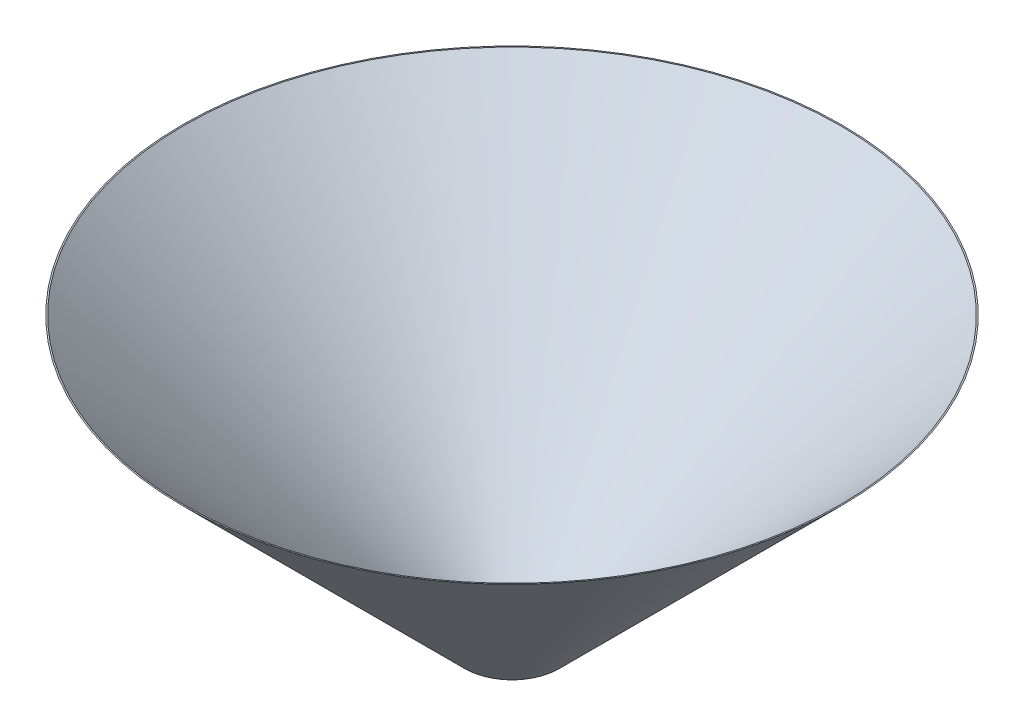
from build123d import *

# Parameters (mm, degrees)
SKETCH2_R           = 50
BOSS_EXTRUDE2_DEPTH = 300
BOSS_EXTRUDE2_DRAFT = -45
SHELL1_T            = 1


with BuildPart() as part:
    # Sketch2 → Boss-Extrude2 (with draft: the straight prism first)
    with BuildSketch(Plane(origin=(0, 0, 0), x_dir=(1, 0, 0), z_dir=(0, 1, 0))):
        Circle(SKETCH2_R)
    extrude(amount=BOSS_EXTRUDE2_DEPTH)
    # Boss-Extrude2: the draft: its side faces are tilted about the plane it starts from
    boss_extrude2_sides = [part.faces().sort_by_distance(p)[0] for p in [
        (-50, 150, 0),
    ]]
    draft(boss_extrude2_sides, Plane(origin=(0, 0, 0), x_dir=(1, 0, 0), z_dir=(0, 1, 0)), BOSS_EXTRUDE2_DRAFT)

    # Shell1
    shell1_openings = [part.faces().sort_by_distance(p)[0] for p in [
        (0, 300, 0),
    ]]
    offset(amount=SHELL1_T, openings=shell1_openings, kind=Kind.INTERSECTION)


solid = part.part
